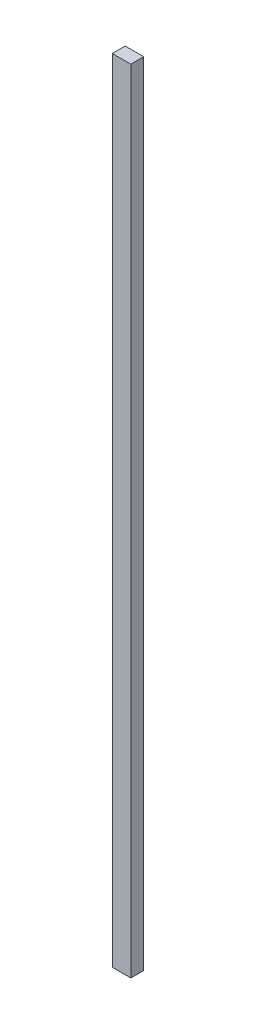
ISO-10303-21;
HEADER;
FILE_DESCRIPTION(('STEP AP214'),'2;1');
FILE_NAME('part.step','',(''),(''),'','','');
FILE_SCHEMA(('AUTOMOTIVE_DESIGN { 1 0 10303 214 1 1 1 1 }'));
ENDSEC;
DATA;
#1=APPLICATION_CONTEXT('core data for automotive mechanical design processes');
#2=APPLICATION_PROTOCOL_DEFINITION('international standard','automotive_design',2000,#1);
#3=PRODUCT_CONTEXT('',#1,'mechanical');
#4=PRODUCT('Part','Part','',(#3));
#5=PRODUCT_RELATED_PRODUCT_CATEGORY('part','',(#4));
#6=PRODUCT_DEFINITION_FORMATION('','',#4);
#7=PRODUCT_DEFINITION_CONTEXT('part definition',#1,'design');
#8=PRODUCT_DEFINITION('design','',#6,#7);
#9=PRODUCT_DEFINITION_SHAPE('','',#8);
#10=(LENGTH_UNIT() NAMED_UNIT(*) SI_UNIT(.MILLI.,.METRE.));
#11=(NAMED_UNIT(*) PLANE_ANGLE_UNIT() SI_UNIT($,.RADIAN.));
#12=(NAMED_UNIT(*) SI_UNIT($,.STERADIAN.) SOLID_ANGLE_UNIT());
#13=UNCERTAINTY_MEASURE_WITH_UNIT(LENGTH_MEASURE(1.E-05),#10,'distance_accuracy_value','');
#14=(GEOMETRIC_REPRESENTATION_CONTEXT(3) GLOBAL_UNCERTAINTY_ASSIGNED_CONTEXT((#13)) GLOBAL_UNIT_ASSIGNED_CONTEXT((#10,
#11,#12)) REPRESENTATION_CONTEXT('',''));
#15=CARTESIAN_POINT('',(0.,0.,0.));
#16=DIRECTION('',(0.,0.,1.));
#17=DIRECTION('',(1.,0.,0.));
#18=AXIS2_PLACEMENT_3D('',#15,#16,#17);
#19=CARTESIAN_POINT('',(-10.614861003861,182.619366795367,3.81));
#20=DIRECTION('',(1.,0.,0.));
#21=DIRECTION('',(0.,1.,0.));
#22=AXIS2_PLACEMENT_3D('',#19,#20,#21);
#23=PLANE('',#22);
#24=DIRECTION('',(0.,-1.,0.));
#25=VECTOR('',#24,1.);
#26=CARTESIAN_POINT('',(-10.614861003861,182.619366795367,0.));
#27=LINE('',#26,#25);
#28=CARTESIAN_POINT('',(-10.614861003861,182.619366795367,0.));
#29=VERTEX_POINT('',#28);
#30=CARTESIAN_POINT('',(-10.614861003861,-50.6796332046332,0.));
#31=VERTEX_POINT('',#30);
#32=EDGE_CURVE('E75',#29,#31,#27,.T.);
#33=ORIENTED_EDGE('',*,*,#32,.T.);
#34=DIRECTION('',(0.,0.,-1.));
#35=VECTOR('',#34,1.);
#36=CARTESIAN_POINT('',(-10.614861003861,-50.6796332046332,3.81));
#37=LINE('',#36,#35);
#38=CARTESIAN_POINT('',(-10.614861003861,-50.6796332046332,3.81));
#39=VERTEX_POINT('',#38);
#40=EDGE_CURVE('E11',#39,#31,#37,.T.);
#41=ORIENTED_EDGE('',*,*,#40,.F.);
#42=DIRECTION('',(0.,-1.,0.));
#43=VECTOR('',#42,1.);
#44=CARTESIAN_POINT('',(-10.614861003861,182.619366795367,3.81));
#45=LINE('',#44,#43);
#46=CARTESIAN_POINT('',(-10.614861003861,182.619366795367,3.81));
#47=VERTEX_POINT('',#46);
#48=EDGE_CURVE('E93',#47,#39,#45,.T.);
#49=ORIENTED_EDGE('',*,*,#48,.F.);
#50=DIRECTION('',(0.,0.,-1.));
#51=VECTOR('',#50,1.);
#52=CARTESIAN_POINT('',(-10.614861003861,182.619366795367,3.81));
#53=LINE('',#52,#51);
#54=EDGE_CURVE('E87',#47,#29,#53,.T.);
#55=ORIENTED_EDGE('',*,*,#54,.T.);
#56=EDGE_LOOP('',(#33,#41,#49,#55));
#57=FACE_BOUND('',#56,.T.);
#58=ADVANCED_FACE('F31',(#57),#23,.F.);
#59=CARTESIAN_POINT('',(-10.614861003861,-50.6796332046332,3.81));
#60=DIRECTION('',(0.,1.,0.));
#61=DIRECTION('',(0.,0.,1.));
#62=AXIS2_PLACEMENT_3D('',#59,#60,#61);
#63=PLANE('',#62);
#64=DIRECTION('',(1.,0.,0.));
#65=VECTOR('',#64,1.);
#66=CARTESIAN_POINT('',(-10.614861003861,-50.6796332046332,0.));
#67=LINE('',#66,#65);
#68=CARTESIAN_POINT('',(-5.153861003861,-50.6796332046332,0.));
#69=VERTEX_POINT('',#68);
#70=EDGE_CURVE('E71',#31,#69,#67,.T.);
#71=ORIENTED_EDGE('',*,*,#70,.T.);
#72=DIRECTION('',(0.,0.,-1.));
#73=VECTOR('',#72,1.);
#74=CARTESIAN_POINT('',(-5.153861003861,-50.6796332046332,3.81));
#75=LINE('',#74,#73);
#76=CARTESIAN_POINT('',(-5.153861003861,-50.6796332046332,3.81));
#77=VERTEX_POINT('',#76);
#78=EDGE_CURVE('E38',#77,#69,#75,.T.);
#79=ORIENTED_EDGE('',*,*,#78,.F.);
#80=DIRECTION('',(1.,0.,0.));
#81=VECTOR('',#80,1.);
#82=CARTESIAN_POINT('',(-10.614861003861,-50.6796332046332,3.81));
#83=LINE('',#82,#81);
#84=EDGE_CURVE('E83',#39,#77,#83,.T.);
#85=ORIENTED_EDGE('',*,*,#84,.F.);
#86=ORIENTED_EDGE('',*,*,#40,.T.);
#87=EDGE_LOOP('',(#71,#79,#85,#86));
#88=FACE_BOUND('',#87,.T.);
#89=ADVANCED_FACE('F82',(#88),#63,.F.);
#90=CARTESIAN_POINT('',(-5.15386100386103,182.619366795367,3.81));
#91=DIRECTION('',(-1.,0.,0.));
#92=DIRECTION('',(0.,-1.,0.));
#93=AXIS2_PLACEMENT_3D('',#90,#91,#92);
#94=PLANE('',#93);
#95=DIRECTION('',(0.,1.,0.));
#96=VECTOR('',#95,1.);
#97=CARTESIAN_POINT('',(-5.15386100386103,182.619366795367,0.));
#98=LINE('',#97,#96);
#99=CARTESIAN_POINT('',(-5.15386100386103,182.619366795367,0.));
#100=VERTEX_POINT('',#99);
#101=EDGE_CURVE('E76',#69,#100,#98,.T.);
#102=ORIENTED_EDGE('',*,*,#101,.T.);
#103=DIRECTION('',(0.,0.,-1.));
#104=VECTOR('',#103,1.);
#105=CARTESIAN_POINT('',(-5.15386100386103,182.619366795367,3.81));
#106=LINE('',#105,#104);
#107=CARTESIAN_POINT('',(-5.15386100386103,182.619366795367,3.81));
#108=VERTEX_POINT('',#107);
#109=EDGE_CURVE('E99',#108,#100,#106,.T.);
#110=ORIENTED_EDGE('',*,*,#109,.F.);
#111=DIRECTION('',(0.,1.,0.));
#112=VECTOR('',#111,1.);
#113=CARTESIAN_POINT('',(-5.15386100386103,182.619366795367,3.81));
#114=LINE('',#113,#112);
#115=EDGE_CURVE('E50',#77,#108,#114,.T.);
#116=ORIENTED_EDGE('',*,*,#115,.F.);
#117=ORIENTED_EDGE('',*,*,#78,.T.);
#118=EDGE_LOOP('',(#102,#110,#116,#117));
#119=FACE_BOUND('',#118,.T.);
#120=ADVANCED_FACE('F102',(#119),#94,.F.);
#121=CARTESIAN_POINT('',(-10.614861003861,182.619366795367,3.81));
#122=DIRECTION('',(0.,-1.,0.));
#123=DIRECTION('',(0.,0.,-1.));
#124=AXIS2_PLACEMENT_3D('',#121,#122,#123);
#125=PLANE('',#124);
#126=DIRECTION('',(-1.,0.,0.));
#127=VECTOR('',#126,1.);
#128=CARTESIAN_POINT('',(-10.614861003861,182.619366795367,0.));
#129=LINE('',#128,#127);
#130=EDGE_CURVE('E91',#100,#29,#129,.T.);
#131=ORIENTED_EDGE('',*,*,#130,.T.);
#132=ORIENTED_EDGE('',*,*,#54,.F.);
#133=DIRECTION('',(-1.,0.,0.));
#134=VECTOR('',#133,1.);
#135=CARTESIAN_POINT('',(-10.614861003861,182.619366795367,3.81));
#136=LINE('',#135,#134);
#137=EDGE_CURVE('E45',#108,#47,#136,.T.);
#138=ORIENTED_EDGE('',*,*,#137,.F.);
#139=ORIENTED_EDGE('',*,*,#109,.T.);
#140=EDGE_LOOP('',(#131,#132,#138,#139));
#141=FACE_BOUND('',#140,.T.);
#142=ADVANCED_FACE('F104',(#141),#125,.F.);
#143=CARTESIAN_POINT('',(-10.614861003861,-50.6796332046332,3.81));
#144=DIRECTION('',(0.,0.,1.));
#145=DIRECTION('',(1.,0.,0.));
#146=AXIS2_PLACEMENT_3D('',#143,#144,#145);
#147=PLANE('',#146);
#148=ORIENTED_EDGE('',*,*,#48,.T.);
#149=ORIENTED_EDGE('',*,*,#84,.T.);
#150=ORIENTED_EDGE('',*,*,#115,.T.);
#151=ORIENTED_EDGE('',*,*,#137,.T.);
#152=EDGE_LOOP('',(#148,#149,#150,#151));
#153=FACE_BOUND('',#152,.T.);
#154=ADVANCED_FACE('F105',(#153),#147,.T.);
#155=CARTESIAN_POINT('',(-10.614861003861,-50.6796332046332,0.));
#156=DIRECTION('',(0.,0.,1.));
#157=DIRECTION('',(1.,0.,0.));
#158=AXIS2_PLACEMENT_3D('',#155,#156,#157);
#159=PLANE('',#158);
#160=ORIENTED_EDGE('',*,*,#32,.F.);
#161=ORIENTED_EDGE('',*,*,#130,.F.);
#162=ORIENTED_EDGE('',*,*,#101,.F.);
#163=ORIENTED_EDGE('',*,*,#70,.F.);
#164=EDGE_LOOP('',(#160,#161,#162,#163));
#165=FACE_BOUND('',#164,.T.);
#166=ADVANCED_FACE('F72',(#165),#159,.F.);
#167=CLOSED_SHELL('',(#58,#89,#120,#142,#154,#166));
#168=MANIFOLD_SOLID_BREP('B2',#167);
#169=ADVANCED_BREP_SHAPE_REPRESENTATION('',(#18,#168),#14);
#170=SHAPE_DEFINITION_REPRESENTATION(#9,#169);
ENDSEC;
END-ISO-10303-21;
